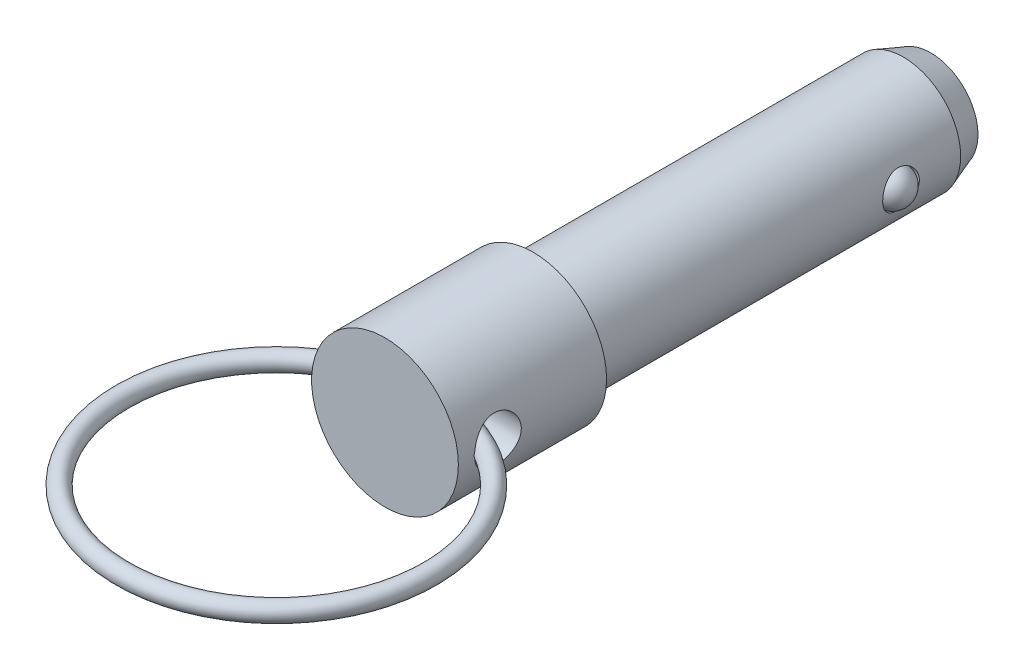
ISO-10303-21;
HEADER;
FILE_DESCRIPTION(('STEP AP214'),'2;1');
FILE_NAME('part.step','',(''),(''),'','','');
FILE_SCHEMA(('AUTOMOTIVE_DESIGN { 1 0 10303 214 1 1 1 1 }'));
ENDSEC;
DATA;
#1=APPLICATION_CONTEXT('core data for automotive mechanical design processes');
#2=APPLICATION_PROTOCOL_DEFINITION('international standard','automotive_design',2000,#1);
#3=PRODUCT_CONTEXT('',#1,'mechanical');
#4=PRODUCT('Part','Part','',(#3));
#5=PRODUCT_RELATED_PRODUCT_CATEGORY('part','',(#4));
#6=PRODUCT_DEFINITION_FORMATION('','',#4);
#7=PRODUCT_DEFINITION_CONTEXT('part definition',#1,'design');
#8=PRODUCT_DEFINITION('design','',#6,#7);
#9=PRODUCT_DEFINITION_SHAPE('','',#8);
#10=(LENGTH_UNIT() NAMED_UNIT(*) SI_UNIT(.MILLI.,.METRE.));
#11=(NAMED_UNIT(*) PLANE_ANGLE_UNIT() SI_UNIT($,.RADIAN.));
#12=(NAMED_UNIT(*) SI_UNIT($,.STERADIAN.) SOLID_ANGLE_UNIT());
#13=UNCERTAINTY_MEASURE_WITH_UNIT(LENGTH_MEASURE(1.E-05),#10,'distance_accuracy_value','');
#14=(GEOMETRIC_REPRESENTATION_CONTEXT(3) GLOBAL_UNCERTAINTY_ASSIGNED_CONTEXT((#13)) GLOBAL_UNIT_ASSIGNED_CONTEXT((#10,
#11,#12)) REPRESENTATION_CONTEXT('',''));
#15=CARTESIAN_POINT('',(0.,0.,0.));
#16=DIRECTION('',(0.,0.,1.));
#17=DIRECTION('',(1.,0.,0.));
#18=AXIS2_PLACEMENT_3D('',#15,#16,#17);
#19=CARTESIAN_POINT('',(7.9375,0.,9.398));
#20=DIRECTION('',(-1.,0.,0.));
#21=DIRECTION('',(0.,0.,-1.));
#22=AXIS2_PLACEMENT_3D('',#19,#20,#21);
#23=CYLINDRICAL_SURFACE('',#22,2.0193);
#24=CARTESIAN_POINT('',(-6.3502,0.292157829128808,11.3960531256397));
#25=CARTESIAN_POINT('',(-6.33446408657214,0.262361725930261,11.4004344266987));
#26=CARTESIAN_POINT('',(-6.32102794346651,0.23122551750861,11.4042829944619));
#27=CARTESIAN_POINT('',(-6.29925234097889,0.167152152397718,11.4106204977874));
#28=CARTESIAN_POINT('',(-6.29090461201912,0.13421801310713,11.413111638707));
#29=CARTESIAN_POINT('',(-6.27972917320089,0.0672091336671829,11.4164621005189));
#30=CARTESIAN_POINT('',(-6.27692077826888,0.0331308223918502,11.4173157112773));
#31=CARTESIAN_POINT('',(-6.27702601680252,-0.0350157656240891,11.4172838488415));
#32=CARTESIAN_POINT('',(-6.27993956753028,-0.0690840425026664,11.4163984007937));
#33=CARTESIAN_POINT('',(-6.29126629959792,-0.135748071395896,11.4130038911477));
#34=CARTESIAN_POINT('',(-6.2996097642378,-0.168356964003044,11.4105154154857));
#35=CARTESIAN_POINT('',(-6.32127848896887,-0.231802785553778,11.404211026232));
#36=CARTESIAN_POINT('',(-6.33461136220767,-0.262636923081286,11.4003930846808));
#37=CARTESIAN_POINT('',(-6.3502,-0.292157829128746,11.3960531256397));
#38=B_SPLINE_CURVE_WITH_KNOTS('',3,(#24,#25,#26,#27,#28,#29,#30,#31,#32,#33,#34,#35,#36,#37),
.UNSPECIFIED.,.F.,.F.,(4,2,2,2,2,2,4),(0.,0.101899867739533,0.203633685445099,0.305721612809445,
0.407808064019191,0.508608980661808,0.609564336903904),.UNSPECIFIED.);
#39=CARTESIAN_POINT('',(-6.3438349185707,0.279747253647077,11.3978284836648));
#40=VERTEX_POINT('',#39);
#41=CARTESIAN_POINT('',(-6.34383491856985,-0.279747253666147,11.3978284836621));
#42=VERTEX_POINT('',#41);
#43=EDGE_CURVE('E39',#40,#42,#38,.T.);
#44=ORIENTED_EDGE('',*,*,#43,.F.);
#45=CARTESIAN_POINT('',(-6.35,0.,11.4173));
#46=CARTESIAN_POINT('',(-6.34999578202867,-0.110312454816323,11.417293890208));
#47=CARTESIAN_POINT('',(-6.34709412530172,-0.220741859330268,11.4082188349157));
#48=CARTESIAN_POINT('',(-6.33578529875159,-0.438477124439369,11.3722159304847));
#49=CARTESIAN_POINT('',(-6.3273687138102,-0.545777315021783,11.3452575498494));
#50=CARTESIAN_POINT('',(-6.30595235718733,-0.753914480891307,11.2744960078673));
#51=CARTESIAN_POINT('',(-6.29296259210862,-0.854765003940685,11.2307296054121));
#52=CARTESIAN_POINT('',(-6.26374009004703,-1.04765917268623,11.1277235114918));
#53=CARTESIAN_POINT('',(-6.247507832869,-1.13970411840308,11.0684861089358));
#54=CARTESIAN_POINT('',(-6.2129360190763,-1.31536123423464,10.9342184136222));
#55=CARTESIAN_POINT('',(-6.19454917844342,-1.39865352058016,10.8587818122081));
#56=CARTESIAN_POINT('',(-6.15801023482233,-1.5516474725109,10.6951184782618));
#57=CARTESIAN_POINT('',(-6.13985819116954,-1.62134576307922,10.606888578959));
#58=CARTESIAN_POINT('',(-6.10533720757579,-1.74691684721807,10.4173629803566));
#59=CARTESIAN_POINT('',(-6.08902613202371,-1.80238797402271,10.315789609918));
#60=CARTESIAN_POINT('',(-6.06074349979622,-1.89532725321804,10.104153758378));
#61=CARTESIAN_POINT('',(-6.0487707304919,-1.93280043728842,9.99409365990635));
#62=CARTESIAN_POINT('',(-6.03101341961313,-1.98750760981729,9.77220930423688));
#63=CARTESIAN_POINT('',(-6.02504825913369,-2.00533395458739,9.66054596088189));
#64=CARTESIAN_POINT('',(-6.01944581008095,-2.02209234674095,9.43566621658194));
#65=CARTESIAN_POINT('',(-6.01980677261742,-2.02102961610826,9.32245025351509));
#66=CARTESIAN_POINT('',(-6.02665663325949,-2.00050250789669,9.10261826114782));
#67=CARTESIAN_POINT('',(-6.03289303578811,-1.98179631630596,8.99592223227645));
#68=CARTESIAN_POINT('',(-6.05038018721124,-1.92774435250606,8.78726894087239));
#69=CARTESIAN_POINT('',(-6.0616315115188,-1.89239667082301,8.68531222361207));
#70=CARTESIAN_POINT('',(-6.08807105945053,-1.8055389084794,8.48724541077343));
#71=CARTESIAN_POINT('',(-6.10331592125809,-1.75379385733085,8.39124624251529));
#72=CARTESIAN_POINT('',(-6.13599834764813,-1.63577635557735,8.20905256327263));
#73=CARTESIAN_POINT('',(-6.15343637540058,-1.56950083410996,8.12286013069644));
#74=CARTESIAN_POINT('',(-6.18954615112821,-1.42061516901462,7.95845350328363));
#75=CARTESIAN_POINT('',(-6.2082373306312,-1.33738288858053,7.88080597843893));
#76=CARTESIAN_POINT('',(-6.24403204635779,-1.15881168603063,7.74040227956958));
#77=CARTESIAN_POINT('',(-6.26113489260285,-1.0634675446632,7.67765255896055));
#78=CARTESIAN_POINT('',(-6.29201953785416,-0.862230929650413,7.56842117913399));
#79=CARTESIAN_POINT('',(-6.30576997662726,-0.756251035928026,7.52209142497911));
#80=CARTESIAN_POINT('',(-6.32815272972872,-0.537579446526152,7.44816775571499));
#81=CARTESIAN_POINT('',(-6.3367955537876,-0.424902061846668,7.4205353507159));
#82=CARTESIAN_POINT('',(-6.34491251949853,-0.259333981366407,7.39474486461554));
#83=CARTESIAN_POINT('',(-6.3468148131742,-0.207677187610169,7.38873516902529));
#84=CARTESIAN_POINT('',(-6.34935954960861,-0.104022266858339,7.38071129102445));
#85=CARTESIAN_POINT('',(-6.35000198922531,-0.0520241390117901,7.37869711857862));
#86=CARTESIAN_POINT('',(-6.34999578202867,0.110312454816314,7.37870610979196));
#87=CARTESIAN_POINT('',(-6.34709412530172,0.220741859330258,7.38778116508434));
#88=CARTESIAN_POINT('',(-6.33578529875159,0.438477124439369,7.42378406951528));
#89=CARTESIAN_POINT('',(-6.3273687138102,0.545777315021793,7.45074245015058));
#90=CARTESIAN_POINT('',(-6.30595235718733,0.753914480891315,7.52150399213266));
#91=CARTESIAN_POINT('',(-6.29296259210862,0.854765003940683,7.56527039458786));
#92=CARTESIAN_POINT('',(-6.26374009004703,1.04765917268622,7.66827648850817));
#93=CARTESIAN_POINT('',(-6.247507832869,1.13970411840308,7.72751389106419));
#94=CARTESIAN_POINT('',(-6.2129360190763,1.31536123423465,7.86178158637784));
#95=CARTESIAN_POINT('',(-6.19454917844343,1.39865352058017,7.93721818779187));
#96=CARTESIAN_POINT('',(-6.15801023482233,1.55164747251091,8.10088152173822));
#97=CARTESIAN_POINT('',(-6.13985819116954,1.62134576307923,8.18911142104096));
#98=CARTESIAN_POINT('',(-6.10533720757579,1.74691684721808,8.37863701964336));
#99=CARTESIAN_POINT('',(-6.08902613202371,1.80238797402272,8.48021039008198));
#100=CARTESIAN_POINT('',(-6.06074349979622,1.89532725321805,8.69184624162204));
#101=CARTESIAN_POINT('',(-6.0487707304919,1.93280043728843,8.80190634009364));
#102=CARTESIAN_POINT('',(-6.03101341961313,1.9875076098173,9.02379069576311));
#103=CARTESIAN_POINT('',(-6.02504825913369,2.0053339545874,9.13545403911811));
#104=CARTESIAN_POINT('',(-6.01944581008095,2.02209234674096,9.36033378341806));
#105=CARTESIAN_POINT('',(-6.01980677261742,2.02102961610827,9.47354974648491));
#106=CARTESIAN_POINT('',(-6.02665663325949,2.0005025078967,9.69338173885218));
#107=CARTESIAN_POINT('',(-6.03289303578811,1.98179631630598,9.80007776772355));
#108=CARTESIAN_POINT('',(-6.05038018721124,1.92774435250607,10.0087310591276));
#109=CARTESIAN_POINT('',(-6.06163151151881,1.89239667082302,10.1106877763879));
#110=CARTESIAN_POINT('',(-6.08807105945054,1.80553890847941,10.3087545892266));
#111=CARTESIAN_POINT('',(-6.1033159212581,1.75379385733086,10.4047537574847));
#112=CARTESIAN_POINT('',(-6.13599834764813,1.63577635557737,10.5869474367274));
#113=CARTESIAN_POINT('',(-6.15343637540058,1.56950083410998,10.6731398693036));
#114=CARTESIAN_POINT('',(-6.18954615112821,1.42061516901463,10.8375464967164));
#115=CARTESIAN_POINT('',(-6.2082373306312,1.33738288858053,10.9151940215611));
#116=CARTESIAN_POINT('',(-6.24403204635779,1.15881168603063,11.0555977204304));
#117=CARTESIAN_POINT('',(-6.26113489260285,1.06346754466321,11.1183474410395));
#118=CARTESIAN_POINT('',(-6.29201953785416,0.862230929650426,11.227578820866));
#119=CARTESIAN_POINT('',(-6.30576997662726,0.756251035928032,11.2739085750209));
#120=CARTESIAN_POINT('',(-6.32815272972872,0.537579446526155,11.347832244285));
#121=CARTESIAN_POINT('',(-6.3367955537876,0.424902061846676,11.3754646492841));
#122=CARTESIAN_POINT('',(-6.34491251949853,0.259333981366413,11.4012551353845));
#123=CARTESIAN_POINT('',(-6.3468148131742,0.207677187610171,11.4072648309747));
#124=CARTESIAN_POINT('',(-6.34935954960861,0.104022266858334,11.4152887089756));
#125=CARTESIAN_POINT('',(-6.35000198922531,0.0520241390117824,11.4173028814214));
#126=CARTESIAN_POINT('',(-6.35,0.,11.4173));
#127=B_SPLINE_CURVE_WITH_KNOTS('',3,(#45,#46,#47,#48,#49,#50,#51,#52,#53,#54,#55,#56,#57,#58,
#59,#60,#61,#62,#63,#64,#65,#66,#67,#68,#69,#70,#71,#72,#73,#74,#75,#76,#77,#78,#79,#80,#81,#82,
#83,#84,#85,#86,#87,#88,#89,#90,#91,#92,#93,#94,#95,#96,#97,#98,#99,#100,#101,#102,#103,#104,
#105,#106,#107,#108,#109,#110,#111,#112,#113,#114,#115,#116,#117,#118,#119,#120,#121,#122,#123,
#124,#125,#126),.UNSPECIFIED.,.T.,.F.,(4,2,2,2,2,2,2,2,2,2,2,2,2,2,2,2,2,2,2,2,2,2,2,2,2,2,2,2,
2,2,2,2,2,2,2,2,2,2,2,2,4),(0.,0.33073688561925,0.662039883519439,0.992622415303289,
1.32315606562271,1.66322530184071,2.00337886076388,2.35228054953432,2.70108463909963,
3.0390572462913,3.37693642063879,3.7009272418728,4.02495524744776,4.35385413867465,
4.68282260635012,5.02727904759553,5.37188442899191,5.71959937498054,6.06659632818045,
6.22257380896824,6.37855167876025,6.7092885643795,7.04059156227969,7.37117409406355,
7.70170774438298,8.04177698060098,8.38193053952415,8.73083222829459,9.07963631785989,
9.41760892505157,9.75548809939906,10.0794789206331,10.403506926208,10.7324058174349,
11.0613742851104,11.4058307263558,11.7504361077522,12.0981510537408,12.4451480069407,
12.6011254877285,12.7571033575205),.UNSPECIFIED.);
#128=EDGE_CURVE('E65',#42,#40,#127,.T.);
#129=ORIENTED_EDGE('',*,*,#128,.F.);
#130=EDGE_LOOP('',(#44,#129));
#131=FACE_BOUND('',#130,.T.);
#132=CARTESIAN_POINT('',(6.3502,-0.292157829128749,11.3960531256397));
#133=CARTESIAN_POINT('',(6.33446408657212,-0.262361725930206,11.4004344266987));
#134=CARTESIAN_POINT('',(6.3210279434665,-0.231225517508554,11.4042829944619));
#135=CARTESIAN_POINT('',(6.29925234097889,-0.167152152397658,11.4106204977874));
#136=CARTESIAN_POINT('',(6.29090461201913,-0.134218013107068,11.413111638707));
#137=CARTESIAN_POINT('',(6.2797291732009,-0.0672091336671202,11.4164621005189));
#138=CARTESIAN_POINT('',(6.27692077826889,-0.0331308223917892,11.4173157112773));
#139=CARTESIAN_POINT('',(6.27702601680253,0.0350157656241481,11.4172838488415));
#140=CARTESIAN_POINT('',(6.27993956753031,0.0690840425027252,11.4163984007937));
#141=CARTESIAN_POINT('',(6.29126629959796,0.135748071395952,11.4130038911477));
#142=CARTESIAN_POINT('',(6.29960976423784,0.168356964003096,11.4105154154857));
#143=CARTESIAN_POINT('',(6.32127848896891,0.231802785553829,11.4042110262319));
#144=CARTESIAN_POINT('',(6.3346113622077,0.262636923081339,11.4003930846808));
#145=CARTESIAN_POINT('',(6.3502,0.292157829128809,11.3960531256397));
#146=B_SPLINE_CURVE_WITH_KNOTS('',3,(#132,#133,#134,#135,#136,#137,#138,#139,#140,#141,#142,
#143,#144,#145),.UNSPECIFIED.,.F.,.F.,(4,2,2,2,2,2,4),(0.,0.101899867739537,0.203633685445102,
0.305721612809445,0.407808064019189,0.508608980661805,0.609564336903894),.UNSPECIFIED.);
#147=CARTESIAN_POINT('',(6.3438349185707,-0.279747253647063,11.3978284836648));
#148=VERTEX_POINT('',#147);
#149=CARTESIAN_POINT('',(6.34383491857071,0.27974725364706,11.3978284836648));
#150=VERTEX_POINT('',#149);
#151=EDGE_CURVE('E32',#148,#150,#146,.T.);
#152=ORIENTED_EDGE('',*,*,#151,.F.);
#153=CARTESIAN_POINT('',(6.35,0.,7.3787));
#154=CARTESIAN_POINT('',(6.34999578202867,-0.11031245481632,7.37870610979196));
#155=CARTESIAN_POINT('',(6.34709412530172,-0.220741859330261,7.38778116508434));
#156=CARTESIAN_POINT('',(6.3357852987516,-0.438477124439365,7.42378406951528));
#157=CARTESIAN_POINT('',(6.32736871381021,-0.545777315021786,7.45074245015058));
#158=CARTESIAN_POINT('',(6.30595235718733,-0.753914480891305,7.52150399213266));
#159=CARTESIAN_POINT('',(6.29296259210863,-0.854765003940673,7.56527039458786));
#160=CARTESIAN_POINT('',(6.26374009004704,-1.04765917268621,7.66827648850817));
#161=CARTESIAN_POINT('',(6.24750783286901,-1.13970411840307,7.72751389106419));
#162=CARTESIAN_POINT('',(6.2129360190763,-1.31536123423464,7.86178158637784));
#163=CARTESIAN_POINT('',(6.19454917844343,-1.39865352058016,7.93721818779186));
#164=CARTESIAN_POINT('',(6.15801023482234,-1.5516474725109,8.10088152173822));
#165=CARTESIAN_POINT('',(6.13985819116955,-1.62134576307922,8.18911142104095));
#166=CARTESIAN_POINT('',(6.1053372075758,-1.74691684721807,8.37863701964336));
#167=CARTESIAN_POINT('',(6.08902613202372,-1.80238797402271,8.48021039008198));
#168=CARTESIAN_POINT('',(6.06074349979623,-1.89532725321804,8.69184624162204));
#169=CARTESIAN_POINT('',(6.04877073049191,-1.93280043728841,8.80190634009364));
#170=CARTESIAN_POINT('',(6.03101341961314,-1.98750760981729,9.02379069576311));
#171=CARTESIAN_POINT('',(6.02504825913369,-2.00533395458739,9.13545403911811));
#172=CARTESIAN_POINT('',(6.01944581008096,-2.02209234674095,9.36033378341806));
#173=CARTESIAN_POINT('',(6.01980677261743,-2.02102961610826,9.47354974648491));
#174=CARTESIAN_POINT('',(6.0266566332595,-2.00050250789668,9.69338173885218));
#175=CARTESIAN_POINT('',(6.03289303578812,-1.98179631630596,9.80007776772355));
#176=CARTESIAN_POINT('',(6.05038018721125,-1.92774435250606,10.0087310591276));
#177=CARTESIAN_POINT('',(6.06163151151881,-1.89239667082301,10.1106877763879));
#178=CARTESIAN_POINT('',(6.08807105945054,-1.8055389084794,10.3087545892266));
#179=CARTESIAN_POINT('',(6.1033159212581,-1.75379385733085,10.4047537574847));
#180=CARTESIAN_POINT('',(6.13599834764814,-1.63577635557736,10.5869474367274));
#181=CARTESIAN_POINT('',(6.15343637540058,-1.56950083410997,10.6731398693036));
#182=CARTESIAN_POINT('',(6.18954615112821,-1.42061516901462,10.8375464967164));
#183=CARTESIAN_POINT('',(6.20823733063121,-1.33738288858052,10.9151940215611));
#184=CARTESIAN_POINT('',(6.2440320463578,-1.15881168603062,11.0555977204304));
#185=CARTESIAN_POINT('',(6.26113489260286,-1.0634675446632,11.1183474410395));
#186=CARTESIAN_POINT('',(6.29201953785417,-0.862230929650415,11.227578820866));
#187=CARTESIAN_POINT('',(6.30576997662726,-0.75625103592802,11.2739085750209));
#188=CARTESIAN_POINT('',(6.32815272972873,-0.537579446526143,11.347832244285));
#189=CARTESIAN_POINT('',(6.33679555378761,-0.424902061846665,11.3754646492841));
#190=CARTESIAN_POINT('',(6.34491251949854,-0.259333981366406,11.4012551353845));
#191=CARTESIAN_POINT('',(6.34681481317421,-0.207677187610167,11.4072648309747));
#192=CARTESIAN_POINT('',(6.34935954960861,-0.104022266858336,11.4152887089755));
#193=CARTESIAN_POINT('',(6.35000198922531,-0.0520241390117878,11.4173028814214));
#194=CARTESIAN_POINT('',(6.34999578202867,0.110312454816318,11.417293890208));
#195=CARTESIAN_POINT('',(6.34709412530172,0.220741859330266,11.4082188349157));
#196=CARTESIAN_POINT('',(6.3357852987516,0.438477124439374,11.3722159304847));
#197=CARTESIAN_POINT('',(6.32736871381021,0.545777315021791,11.3452575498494));
#198=CARTESIAN_POINT('',(6.30595235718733,0.753914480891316,11.2744960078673));
#199=CARTESIAN_POINT('',(6.29296259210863,0.854765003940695,11.2307296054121));
#200=CARTESIAN_POINT('',(6.26374009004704,1.04765917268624,11.1277235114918));
#201=CARTESIAN_POINT('',(6.24750783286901,1.13970411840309,11.0684861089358));
#202=CARTESIAN_POINT('',(6.2129360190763,1.31536123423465,10.9342184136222));
#203=CARTESIAN_POINT('',(6.19454917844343,1.39865352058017,10.8587818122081));
#204=CARTESIAN_POINT('',(6.15801023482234,1.55164747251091,10.6951184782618));
#205=CARTESIAN_POINT('',(6.13985819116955,1.62134576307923,10.606888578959));
#206=CARTESIAN_POINT('',(6.1053372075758,1.74691684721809,10.4173629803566));
#207=CARTESIAN_POINT('',(6.08902613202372,1.80238797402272,10.315789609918));
#208=CARTESIAN_POINT('',(6.06074349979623,1.89532725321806,10.104153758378));
#209=CARTESIAN_POINT('',(6.04877073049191,1.93280043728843,9.99409365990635));
#210=CARTESIAN_POINT('',(6.03101341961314,1.98750760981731,9.77220930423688));
#211=CARTESIAN_POINT('',(6.02504825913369,2.0053339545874,9.66054596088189));
#212=CARTESIAN_POINT('',(6.01944581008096,2.02209234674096,9.43566621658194));
#213=CARTESIAN_POINT('',(6.01980677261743,2.02102961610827,9.32245025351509));
#214=CARTESIAN_POINT('',(6.0266566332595,2.0005025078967,9.10261826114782));
#215=CARTESIAN_POINT('',(6.03289303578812,1.98179631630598,8.99592223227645));
#216=CARTESIAN_POINT('',(6.05038018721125,1.92774435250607,8.78726894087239));
#217=CARTESIAN_POINT('',(6.06163151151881,1.89239667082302,8.68531222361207));
#218=CARTESIAN_POINT('',(6.08807105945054,1.80553890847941,8.48724541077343));
#219=CARTESIAN_POINT('',(6.1033159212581,1.75379385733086,8.39124624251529));
#220=CARTESIAN_POINT('',(6.13599834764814,1.63577635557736,8.20905256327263));
#221=CARTESIAN_POINT('',(6.15343637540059,1.56950083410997,8.12286013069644));
#222=CARTESIAN_POINT('',(6.18954615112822,1.42061516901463,7.95845350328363));
#223=CARTESIAN_POINT('',(6.20823733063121,1.33738288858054,7.88080597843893));
#224=CARTESIAN_POINT('',(6.2440320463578,1.15881168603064,7.74040227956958));
#225=CARTESIAN_POINT('',(6.26113489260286,1.06346754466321,7.67765255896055));
#226=CARTESIAN_POINT('',(6.29201953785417,0.862230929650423,7.56842117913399));
#227=CARTESIAN_POINT('',(6.30576997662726,0.756251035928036,7.52209142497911));
#228=CARTESIAN_POINT('',(6.32815272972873,0.537579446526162,7.44816775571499));
#229=CARTESIAN_POINT('',(6.33679555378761,0.424902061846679,7.4205353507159));
#230=CARTESIAN_POINT('',(6.34491251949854,0.259333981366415,7.39474486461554));
#231=CARTESIAN_POINT('',(6.34681481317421,0.207677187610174,7.38873516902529));
#232=CARTESIAN_POINT('',(6.34935954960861,0.104022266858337,7.38071129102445));
#233=CARTESIAN_POINT('',(6.35000198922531,0.0520241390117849,7.37869711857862));
#234=CARTESIAN_POINT('',(6.35,0.,7.3787));
#235=B_SPLINE_CURVE_WITH_KNOTS('',3,(#153,#154,#155,#156,#157,#158,#159,#160,#161,#162,#163,
#164,#165,#166,#167,#168,#169,#170,#171,#172,#173,#174,#175,#176,#177,#178,#179,#180,#181,#182,
#183,#184,#185,#186,#187,#188,#189,#190,#191,#192,#193,#194,#195,#196,#197,#198,#199,#200,#201,
#202,#203,#204,#205,#206,#207,#208,#209,#210,#211,#212,#213,#214,#215,#216,#217,#218,#219,#220,
#221,#222,#223,#224,#225,#226,#227,#228,#229,#230,#231,#232,#233,#234),.UNSPECIFIED.,.T.,.F.,(4,
2,2,2,2,2,2,2,2,2,2,2,2,2,2,2,2,2,2,2,2,2,2,2,2,2,2,2,2,2,2,2,2,2,2,2,2,2,2,2,4),(0.,
0.330736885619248,0.662039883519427,0.992622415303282,1.32315606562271,1.66322530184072,
2.00337886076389,2.35228054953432,2.70108463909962,3.03905724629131,3.3769364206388,
3.70092724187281,4.02495524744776,4.35385413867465,4.68282260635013,5.02727904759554,
5.37188442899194,5.71959937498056,6.06659632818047,6.22257380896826,6.37855167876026,
6.70928856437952,7.04059156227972,7.37117409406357,7.70170774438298,8.04177698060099,
8.38193053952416,8.7308322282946,9.07963631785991,9.41760892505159,9.75548809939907,
10.0794789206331,10.403506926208,10.7324058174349,11.0613742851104,11.4058307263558,
11.7504361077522,12.0981510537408,12.4451480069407,12.6011254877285,12.7571033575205),.UNSPECIFIED.);
#236=EDGE_CURVE('E61',#150,#148,#235,.T.);
#237=ORIENTED_EDGE('',*,*,#236,.F.);
#238=EDGE_LOOP('',(#152,#237));
#239=FACE_BOUND('',#238,.T.);
#240=ADVANCED_FACE('F14',(#131,#239),#23,.F.);
#241=CARTESIAN_POINT('',(0.,0.,-34.39922));
#242=DIRECTION('',(0.,0.,-1.));
#243=DIRECTION('',(1.,0.,0.));
#244=AXIS2_PLACEMENT_3D('',#241,#242,#243);
#245=CYLINDRICAL_SURFACE('',#244,6.35);
#246=ORIENTED_EDGE('',*,*,#236,.T.);
#247=CARTESIAN_POINT('',(6.34665582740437,-0.206057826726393,9.6663673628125));
#248=CARTESIAN_POINT('',(6.34528498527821,-0.248279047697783,9.67828523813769));
#249=CARTESIAN_POINT('',(6.34352249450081,-0.289459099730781,9.69386090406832));
#250=CARTESIAN_POINT('',(6.33942011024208,-0.36854309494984,9.7317801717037));
#251=CARTESIAN_POINT('',(6.33708008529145,-0.406446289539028,9.75412531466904));
#252=CARTESIAN_POINT('',(6.33209241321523,-0.477899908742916,9.8047666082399));
#253=CARTESIAN_POINT('',(6.32944535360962,-0.511458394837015,9.83305147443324));
#254=CARTESIAN_POINT('',(6.32412241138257,-0.573540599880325,9.89467297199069));
#255=CARTESIAN_POINT('',(6.32144652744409,-0.602064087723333,9.92800983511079));
#256=CARTESIAN_POINT('',(6.31623478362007,-0.654523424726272,10.0000464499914));
#257=CARTESIAN_POINT('',(6.31370785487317,-0.678248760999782,10.0388997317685));
#258=CARTESIAN_POINT('',(6.30914807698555,-0.719430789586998,10.1198151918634));
#259=CARTESIAN_POINT('',(6.30711537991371,-0.736885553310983,10.1618783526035));
#260=CARTESIAN_POINT('',(6.30356963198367,-0.766652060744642,10.2517585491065));
#261=CARTESIAN_POINT('',(6.3021147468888,-0.778407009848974,10.2997618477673));
#262=CARTESIAN_POINT('',(6.30009638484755,-0.794575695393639,10.3969997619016));
#263=CARTESIAN_POINT('',(6.29953326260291,-0.79898651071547,10.4462348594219));
#264=CARTESIAN_POINT('',(6.29930439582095,-0.800791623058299,10.5499764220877));
#265=CARTESIAN_POINT('',(6.29973840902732,-0.797405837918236,10.6044969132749));
#266=CARTESIAN_POINT('',(6.30162771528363,-0.782332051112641,10.7123814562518));
#267=CARTESIAN_POINT('',(6.30308376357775,-0.770637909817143,10.7657446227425));
#268=CARTESIAN_POINT('',(6.30699495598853,-0.737976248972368,10.8743575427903));
#269=CARTESIAN_POINT('',(6.30952256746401,-0.716323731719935,10.9294001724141));
#270=CARTESIAN_POINT('',(6.31524450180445,-0.663986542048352,11.0349896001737));
#271=CARTESIAN_POINT('',(6.31843852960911,-0.633305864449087,11.0855383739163));
#272=CARTESIAN_POINT('',(6.32446092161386,-0.569663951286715,11.1714846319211));
#273=CARTESIAN_POINT('',(6.32724886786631,-0.538153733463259,11.2079604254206));
#274=CARTESIAN_POINT('',(6.33270636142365,-0.46958313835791,11.2752665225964));
#275=CARTESIAN_POINT('',(6.33537605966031,-0.432530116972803,11.3061041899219));
#276=CARTESIAN_POINT('',(6.33987873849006,-0.359908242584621,11.3561064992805));
#277=CARTESIAN_POINT('',(6.34177713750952,-0.325092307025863,11.3763560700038));
#278=CARTESIAN_POINT('',(6.34507913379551,-0.252556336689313,11.4108259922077));
#279=CARTESIAN_POINT('',(6.34648300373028,-0.214837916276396,11.4250496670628));
#280=CARTESIAN_POINT('',(6.34863622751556,-0.137224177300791,11.4466382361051));
#281=CARTESIAN_POINT('',(6.34938200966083,-0.0973182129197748,11.4539657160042));
#282=CARTESIAN_POINT('',(6.35010496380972,-0.01683349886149,11.4610716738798));
#283=CARTESIAN_POINT('',(6.35008242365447,0.0237449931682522,11.4608529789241));
#284=CARTESIAN_POINT('',(6.34931136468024,0.100393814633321,11.4532686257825));
#285=CARTESIAN_POINT('',(6.34863038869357,0.136533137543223,11.4465678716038));
#286=CARTESIAN_POINT('',(6.34671646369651,0.207223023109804,11.4274006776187));
#287=CARTESIAN_POINT('',(6.34548344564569,0.241773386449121,11.4149335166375));
#288=CARTESIAN_POINT('',(6.34254165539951,0.309606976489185,11.3844132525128));
#289=CARTESIAN_POINT('',(6.34081891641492,0.342814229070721,11.3661941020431));
#290=CARTESIAN_POINT('',(6.33707366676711,0.406211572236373,11.3251453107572));
#291=CARTESIAN_POINT('',(6.33505103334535,0.436400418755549,11.3023137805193));
#292=CARTESIAN_POINT('',(6.33055131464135,0.497695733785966,11.2491439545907));
#293=CARTESIAN_POINT('',(6.32805141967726,0.528268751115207,11.2181940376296));
#294=CARTESIAN_POINT('',(6.32308163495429,0.584759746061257,11.1523092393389));
#295=CARTESIAN_POINT('',(6.32061176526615,0.610674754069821,11.1173718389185));
#296=CARTESIAN_POINT('',(6.315456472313,0.662038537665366,11.0376631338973));
#297=CARTESIAN_POINT('',(6.31281513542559,0.686522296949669,10.9922657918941));
#298=CARTESIAN_POINT('',(6.30810097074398,0.728566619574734,10.8983369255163));
#299=CARTESIAN_POINT('',(6.30602851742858,0.74612262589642,10.8498033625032));
#300=CARTESIAN_POINT('',(6.30243933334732,0.775896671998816,10.7442183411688));
#301=CARTESIAN_POINT('',(6.30103001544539,0.787122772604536,10.6868803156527));
#302=CARTESIAN_POINT('',(6.29940721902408,0.800007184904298,10.5710986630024));
#303=CARTESIAN_POINT('',(6.29919407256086,0.801662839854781,10.5126547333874));
#304=CARTESIAN_POINT('',(6.30005021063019,0.794909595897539,10.3956729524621));
#305=CARTESIAN_POINT('',(6.30113381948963,0.786388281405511,10.3371413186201));
#306=CARTESIAN_POINT('',(6.30452399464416,0.758730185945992,10.2226628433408));
#307=CARTESIAN_POINT('',(6.30682981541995,0.739599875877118,10.1667144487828));
#308=CARTESIAN_POINT('',(6.31212037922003,0.692916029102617,10.0644672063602));
#309=CARTESIAN_POINT('',(6.31502617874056,0.666266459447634,10.0177527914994));
#310=CARTESIAN_POINT('',(6.32122790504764,0.604592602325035,9.93024699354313));
#311=CARTESIAN_POINT('',(6.32452352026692,0.569574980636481,9.88945093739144));
#312=CARTESIAN_POINT('',(6.33066231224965,0.496394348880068,9.81967919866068));
#313=CARTESIAN_POINT('',(6.33351542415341,0.458999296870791,9.78989736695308));
#314=CARTESIAN_POINT('',(6.33878167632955,0.379383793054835,9.7376345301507));
#315=CARTESIAN_POINT('',(6.34119502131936,0.337165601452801,9.71515012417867));
#316=CARTESIAN_POINT('',(6.34510608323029,0.252558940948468,9.67976956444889));
#317=CARTESIAN_POINT('',(6.34665878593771,0.210419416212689,9.66628201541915));
#318=CARTESIAN_POINT('',(6.34892624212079,0.124425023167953,9.64681261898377));
#319=CARTESIAN_POINT('',(6.34964132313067,0.0805708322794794,9.64082783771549));
#320=CARTESIAN_POINT('',(6.3501300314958,-0.00429887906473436,9.63672685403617));
#321=CARTESIAN_POINT('',(6.3499683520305,-0.0452888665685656,9.63806999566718));
#322=CARTESIAN_POINT('',(6.34886964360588,-0.126506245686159,9.64734016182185));
#323=CARTESIAN_POINT('',(6.34793260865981,-0.16673363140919,9.65526723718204));
#324=CARTESIAN_POINT('',(6.34665582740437,-0.206057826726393,9.6663673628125));
#325=B_SPLINE_CURVE_WITH_KNOTS('',3,(#247,#248,#249,#250,#251,#252,#253,#254,#255,#256,#257,
#258,#259,#260,#261,#262,#263,#264,#265,#266,#267,#268,#269,#270,#271,#272,#273,#274,#275,#276,
#277,#278,#279,#280,#281,#282,#283,#284,#285,#286,#287,#288,#289,#290,#291,#292,#293,#294,#295,
#296,#297,#298,#299,#300,#301,#302,#303,#304,#305,#306,#307,#308,#309,#310,#311,#312,#313,#314,
#315,#316,#317,#318,#319,#320,#321,#322,#323,#324),.UNSPECIFIED.,.T.,.F.,(4,2,2,2,2,2,2,2,2,2,2,
2,2,2,2,2,2,2,2,2,2,2,2,2,2,2,2,2,2,2,2,2,2,2,2,2,2,2,4),(0.,0.131523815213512,
0.263077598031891,0.394383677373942,0.525695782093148,0.661900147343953,0.798146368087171,
0.945864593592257,1.09364155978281,1.25683680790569,1.42015277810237,1.59693202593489,
1.7736331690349,1.91791685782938,2.06201073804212,2.1824766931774,2.30287612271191,
2.42392505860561,2.54492864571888,2.65470676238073,2.76449861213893,2.87780525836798,
2.99115841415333,3.12140054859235,3.25172542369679,3.40605418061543,3.56048428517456,
3.73501068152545,3.90958552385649,4.08610670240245,4.2625203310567,4.42319186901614,
4.58373584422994,4.72664586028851,4.86948917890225,5.00164792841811,5.13375498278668,
5.25625329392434,5.37875255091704),.UNSPECIFIED.);
#326=EDGE_CURVE('E26',#148,#150,#325,.T.);
#327=ORIENTED_EDGE('',*,*,#326,.T.);
#328=EDGE_LOOP('',(#246,#327));
#329=FACE_BOUND('',#328,.T.);
#330=CARTESIAN_POINT('',(0.,0.,12.8270000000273));
#331=DIRECTION('',(0.,0.,-1.));
#332=DIRECTION('',(1.,0.,0.));
#333=AXIS2_PLACEMENT_3D('',#330,#331,#332);
#334=CIRCLE('',#333,6.34999999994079);
#335=CARTESIAN_POINT('',(6.34999999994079,0.,12.8270000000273));
#336=VERTEX_POINT('',#335);
#337=EDGE_CURVE('E70',#336,#336,#334,.T.);
#338=ORIENTED_EDGE('',*,*,#337,.T.);
#339=EDGE_LOOP('',(#338));
#340=FACE_BOUND('',#339,.T.);
#341=CARTESIAN_POINT('',(0.,0.,1.16018306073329E-11));
#342=DIRECTION('',(0.,0.,-1.));
#343=DIRECTION('',(1.,0.,0.));
#344=AXIS2_PLACEMENT_3D('',#341,#342,#343);
#345=CIRCLE('',#344,6.34999999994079);
#346=CARTESIAN_POINT('',(6.3499999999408,0.,1.16015507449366E-11));
#347=VERTEX_POINT('',#346);
#348=EDGE_CURVE('E280',#347,#347,#345,.T.);
#349=ORIENTED_EDGE('',*,*,#348,.F.);
#350=EDGE_LOOP('',(#349));
#351=FACE_BOUND('',#350,.T.);
#352=ORIENTED_EDGE('',*,*,#128,.T.);
#353=CARTESIAN_POINT('',(-6.34665582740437,-0.206057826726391,9.6663673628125));
#354=CARTESIAN_POINT('',(-6.34797934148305,-0.165285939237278,9.65485950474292));
#355=CARTESIAN_POINT('',(-6.34893816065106,-0.123532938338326,9.64675937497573));
#356=CARTESIAN_POINT('',(-6.35001869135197,-0.0392395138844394,9.63764831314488));
#357=CARTESIAN_POINT('',(-6.35014017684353,0.00330111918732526,9.63663929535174));
#358=CARTESIAN_POINT('',(-6.34953206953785,0.0879394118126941,9.64174776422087));
#359=CARTESIAN_POINT('',(-6.34880260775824,0.13003713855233,9.6478641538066));
#360=CARTESIAN_POINT('',(-6.34657447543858,0.212600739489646,9.66701677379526));
#361=CARTESIAN_POINT('',(-6.34507584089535,0.253066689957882,9.68005268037));
#362=CARTESIAN_POINT('',(-6.34146900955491,0.33138158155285,9.7126623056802));
#363=CARTESIAN_POINT('',(-6.33935898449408,0.36922224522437,9.73225566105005));
#364=CARTESIAN_POINT('',(-6.33475813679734,0.441182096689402,9.77733154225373));
#365=CARTESIAN_POINT('',(-6.33226728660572,0.47530101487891,9.80281449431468));
#366=CARTESIAN_POINT('',(-6.32708436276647,0.539990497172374,9.85971055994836));
#367=CARTESIAN_POINT('',(-6.3243885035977,0.570424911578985,9.89127784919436));
#368=CARTESIAN_POINT('',(-6.3191381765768,0.625916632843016,9.95882994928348));
#369=CARTESIAN_POINT('',(-6.31658374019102,0.650972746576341,9.9948157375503));
#370=CARTESIAN_POINT('',(-6.31170869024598,0.696703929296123,10.0724886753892));
#371=CARTESIAN_POINT('',(-6.30941195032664,0.717017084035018,10.1143899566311));
#372=CARTESIAN_POINT('',(-6.30545539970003,0.751016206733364,10.2008200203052));
#373=CARTESIAN_POINT('',(-6.30379582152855,0.764699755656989,10.245349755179));
#374=CARTESIAN_POINT('',(-6.30112261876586,0.786439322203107,10.3401349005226));
#375=CARTESIAN_POINT('',(-6.30018307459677,0.793856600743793,10.3905385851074));
#376=CARTESIAN_POINT('',(-6.29927265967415,0.801046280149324,10.4918905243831));
#377=CARTESIAN_POINT('',(-6.2993021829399,0.80081557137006,10.5428389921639));
#378=CARTESIAN_POINT('',(-6.30034248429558,0.792594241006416,10.6494235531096));
#379=CARTESIAN_POINT('',(-6.30145478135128,0.783800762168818,10.7049973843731));
#380=CARTESIAN_POINT('',(-6.30465473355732,0.75762808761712,10.8140964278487));
#381=CARTESIAN_POINT('',(-6.30674324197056,0.740241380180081,10.8676198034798));
#382=CARTESIAN_POINT('',(-6.31179783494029,0.695872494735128,10.9743734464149));
#383=CARTESIAN_POINT('',(-6.31480965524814,0.668369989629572,11.0273869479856));
#384=CARTESIAN_POINT('',(-6.32125797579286,0.604341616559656,11.127620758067));
#385=CARTESIAN_POINT('',(-6.32469393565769,0.567827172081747,11.1748482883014));
#386=CARTESIAN_POINT('',(-6.33064540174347,0.496358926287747,11.2504526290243));
#387=CARTESIAN_POINT('',(-6.33317742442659,0.463272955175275,11.2805972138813));
#388=CARTESIAN_POINT('',(-6.3379511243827,0.392589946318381,11.3350975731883));
#389=CARTESIAN_POINT('',(-6.3401929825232,0.35499574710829,11.3594569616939));
#390=CARTESIAN_POINT('',(-6.34414022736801,0.275631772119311,11.4012144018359));
#391=CARTESIAN_POINT('',(-6.34584084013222,0.233828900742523,11.418550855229));
#392=CARTESIAN_POINT('',(-6.34843013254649,0.147595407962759,11.4446164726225));
#393=CARTESIAN_POINT('',(-6.34931975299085,0.103167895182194,11.4533556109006));
#394=CARTESIAN_POINT('',(-6.35008514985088,0.0199378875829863,11.4608753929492));
#395=CARTESIAN_POINT('',(-6.35008843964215,-0.0187536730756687,11.4609085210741));
#396=CARTESIAN_POINT('',(-6.34939746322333,-0.09551707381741,11.4541183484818));
#397=CARTESIAN_POINT('',(-6.34870331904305,-0.13358902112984,11.4472962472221));
#398=CARTESIAN_POINT('',(-6.34675486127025,-0.206035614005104,11.4277870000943));
#399=CARTESIAN_POINT('',(-6.34553149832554,-0.240499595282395,11.4154227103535));
#400=CARTESIAN_POINT('',(-6.34265636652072,-0.307121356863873,11.3856122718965));
#401=CARTESIAN_POINT('',(-6.34100449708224,-0.339278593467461,11.3681649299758));
#402=CARTESIAN_POINT('',(-6.3372369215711,-0.403825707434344,11.3269948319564));
#403=CARTESIAN_POINT('',(-6.33509154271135,-0.435925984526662,11.3028229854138));
#404=CARTESIAN_POINT('',(-6.33064272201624,-0.496369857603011,11.250192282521));
#405=CARTESIAN_POINT('',(-6.32833919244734,-0.524711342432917,11.2217310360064));
#406=CARTESIAN_POINT('',(-6.32334030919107,-0.582098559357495,11.1560085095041));
#407=CARTESIAN_POINT('',(-6.32064774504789,-0.610381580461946,11.118081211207));
#408=CARTESIAN_POINT('',(-6.31552631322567,-0.661272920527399,11.0385798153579));
#409=CARTESIAN_POINT('',(-6.31309762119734,-0.683877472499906,10.9970033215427));
#410=CARTESIAN_POINT('',(-6.30833642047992,-0.726588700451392,10.9038901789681));
#411=CARTESIAN_POINT('',(-6.30608942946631,-0.745628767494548,10.851857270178));
#412=CARTESIAN_POINT('',(-6.30248979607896,-0.775466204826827,10.7454330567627));
#413=CARTESIAN_POINT('',(-6.30113765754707,-0.786258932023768,10.69104044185));
#414=CARTESIAN_POINT('',(-6.29944352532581,-0.799728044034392,10.5770263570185));
#415=CARTESIAN_POINT('',(-6.29918591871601,-0.801726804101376,10.5173211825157));
#416=CARTESIAN_POINT('',(-6.30000525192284,-0.795264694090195,10.3984664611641));
#417=CARTESIAN_POINT('',(-6.30108195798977,-0.786805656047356,10.3393168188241));
#418=CARTESIAN_POINT('',(-6.30440515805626,-0.759704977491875,10.2262823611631));
#419=CARTESIAN_POINT('',(-6.30659553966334,-0.741549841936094,10.1722805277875));
#420=CARTESIAN_POINT('',(-6.31185428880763,-0.695364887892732,10.0687073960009));
#421=CARTESIAN_POINT('',(-6.31492202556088,-0.66734216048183,10.0191329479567));
#422=CARTESIAN_POINT('',(-6.32113146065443,-0.605515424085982,9.93168975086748));
#423=CARTESIAN_POINT('',(-6.32422841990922,-0.572678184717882,9.89313380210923));
#424=CARTESIAN_POINT('',(-6.33035789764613,-0.500375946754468,9.82285661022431));
#425=CARTESIAN_POINT('',(-6.3333904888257,-0.460918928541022,9.79112724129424));
#426=CARTESIAN_POINT('',(-6.33833786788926,-0.386069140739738,9.74204682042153));
#427=CARTESIAN_POINT('',(-6.34035098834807,-0.351739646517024,9.72306715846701));
#428=CARTESIAN_POINT('',(-6.34389840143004,-0.28057152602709,9.69054512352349));
#429=CARTESIAN_POINT('',(-6.3454328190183,-0.243733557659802,9.67700133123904));
#430=CARTESIAN_POINT('',(-6.34665582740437,-0.206057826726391,9.6663673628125));
#431=B_SPLINE_CURVE_WITH_KNOTS('',3,(#353,#354,#355,#356,#357,#358,#359,#360,#361,#362,#363,
#364,#365,#366,#367,#368,#369,#370,#371,#372,#373,#374,#375,#376,#377,#378,#379,#380,#381,#382,
#383,#384,#385,#386,#387,#388,#389,#390,#391,#392,#393,#394,#395,#396,#397,#398,#399,#400,#401,
#402,#403,#404,#405,#406,#407,#408,#409,#410,#411,#412,#413,#414,#415,#416,#417,#418,#419,#420,
#421,#422,#423,#424,#425,#426,#427,#428,#429,#430),.UNSPECIFIED.,.T.,.F.,(4,2,2,2,2,2,2,2,2,2,2,
2,2,2,2,2,2,2,2,2,2,2,2,2,2,2,2,2,2,2,2,2,2,2,2,2,2,2,4),(0.,0.127017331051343,
0.254068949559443,0.381101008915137,0.508127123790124,0.635537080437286,0.762956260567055,
0.894175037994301,1.0254228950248,1.16470220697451,1.30403230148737,1.45626942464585,
1.60856844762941,1.7766734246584,1.94492561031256,2.12343441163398,2.30171808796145,
2.43568966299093,2.56957732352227,2.70461513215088,2.83949608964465,2.95496006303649,
3.07040383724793,3.17985460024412,3.28933107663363,3.40960027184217,3.52993673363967,
3.6715656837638,3.81328834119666,3.97894617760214,4.14469720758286,4.32301887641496,
4.50130931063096,4.67139503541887,4.84135878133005,4.99274402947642,5.14394807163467,
5.26135056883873,5.3787223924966),.UNSPECIFIED.);
#432=EDGE_CURVE('E9',#40,#42,#431,.T.);
#433=ORIENTED_EDGE('',*,*,#432,.T.);
#434=EDGE_LOOP('',(#352,#433));
#435=FACE_BOUND('',#434,.T.);
#436=ADVANCED_FACE('F63',(#329,#340,#351,#435),#245,.T.);
#437=CARTESIAN_POINT('',(0.,-6.096,12.827));
#438=DIRECTION('',(0.,0.,1.));
#439=DIRECTION('',(-1.,0.,0.));
#440=AXIS2_PLACEMENT_3D('',#437,#438,#439);
#441=PLANE('',#440);
#442=ORIENTED_EDGE('',*,*,#337,.F.);
#443=EDGE_LOOP('',(#442));
#444=FACE_BOUND('',#443,.T.);
#445=ADVANCED_FACE('F85',(#444),#441,.T.);
#446=CARTESIAN_POINT('',(0.,-4.95554,0.));
#447=DIRECTION('',(0.,0.,-1.));
#448=DIRECTION('',(1.,0.,0.));
#449=AXIS2_PLACEMENT_3D('',#446,#447,#448);
#450=PLANE('',#449);
#451=ORIENTED_EDGE('',*,*,#348,.T.);
#452=EDGE_LOOP('',(#451));
#453=FACE_BOUND('',#452,.T.);
#454=CARTESIAN_POINT('',(0.,0.,0.));
#455=DIRECTION('',(0.,0.,-1.));
#456=DIRECTION('',(-1.,0.,0.));
#457=AXIS2_PLACEMENT_3D('',#454,#455,#456);
#458=CIRCLE('',#457,4.95554);
#459=CARTESIAN_POINT('',(-4.95554,0.,0.));
#460=VERTEX_POINT('',#459);
#461=EDGE_CURVE('E59',#460,#460,#458,.F.);
#462=ORIENTED_EDGE('',*,*,#461,.T.);
#463=EDGE_LOOP('',(#462));
#464=FACE_BOUND('',#463,.T.);
#465=ADVANCED_FACE('F16',(#453,#464),#450,.T.);
#466=CARTESIAN_POINT('',(-4.2037,0.,-26.88082));
#467=DIRECTION('',(0.,0.,-1.));
#468=DIRECTION('',(1.,0.,0.));
#469=AXIS2_PLACEMENT_3D('',#466,#467,#468);
#470=SPHERICAL_SURFACE('',#469,1.5875);
#471=CARTESIAN_POINT('',(-4.2037,0.,-26.88082));
#472=DIRECTION('',(1.,0.,0.));
#473=DIRECTION('',(0.,0.,-1.));
#474=AXIS2_PLACEMENT_3D('',#471,#472,#473);
#475=CIRCLE('',#474,1.5875);
#476=CARTESIAN_POINT('',(-4.2037,0.,-28.46832));
#477=VERTEX_POINT('',#476);
#478=CARTESIAN_POINT('',(-4.2037,0.,-25.29332));
#479=VERTEX_POINT('',#478);
#480=EDGE_CURVE('E111',#477,#479,#475,.F.);
#481=ORIENTED_EDGE('',*,*,#480,.T.);
#482=CARTESIAN_POINT('',(-4.2037,0.,-26.88082));
#483=DIRECTION('',(1.,0.,0.));
#484=DIRECTION('',(0.,0.,-1.));
#485=AXIS2_PLACEMENT_3D('',#482,#483,#484);
#486=CIRCLE('',#485,1.5875);
#487=EDGE_CURVE('E140',#479,#477,#486,.F.);
#488=ORIENTED_EDGE('',*,*,#487,.T.);
#489=EDGE_LOOP('',(#481,#488));
#490=FACE_BOUND('',#489,.T.);
#491=ADVANCED_FACE('F119',(#490),#470,.T.);
#492=CARTESIAN_POINT('',(0.,0.,-34.39922));
#493=DIRECTION('',(0.,0.,-1.));
#494=DIRECTION('',(-1.,0.,0.));
#495=AXIS2_PLACEMENT_3D('',#492,#493,#494);
#496=PLANE('',#495);
#497=CARTESIAN_POINT('',(0.,0.,-34.3992200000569));
#498=DIRECTION('',(0.,0.,1.));
#499=DIRECTION('',(1.,0.,0.));
#500=AXIS2_PLACEMENT_3D('',#497,#498,#499);
#501=CIRCLE('',#500,4.0957695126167);
#502=CARTESIAN_POINT('',(4.09576951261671,0.,-34.3992200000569));
#503=VERTEX_POINT('',#502);
#504=EDGE_CURVE('E146',#503,#503,#501,.T.);
#505=ORIENTED_EDGE('',*,*,#504,.F.);
#506=EDGE_LOOP('',(#505));
#507=FACE_BOUND('',#506,.T.);
#508=ADVANCED_FACE('F122',(#507),#496,.T.);
#509=CARTESIAN_POINT('',(4.2037,0.,-26.88082));
#510=DIRECTION('',(0.,0.,1.));
#511=DIRECTION('',(1.,0.,0.));
#512=AXIS2_PLACEMENT_3D('',#509,#510,#511);
#513=SPHERICAL_SURFACE('',#512,1.5875);
#514=CARTESIAN_POINT('',(4.2037,0.,-26.88082));
#515=DIRECTION('',(1.,0.,0.));
#516=DIRECTION('',(0.,0.,-1.));
#517=AXIS2_PLACEMENT_3D('',#514,#515,#516);
#518=CIRCLE('',#517,1.5875);
#519=CARTESIAN_POINT('',(4.2037,0.,-28.46832));
#520=VERTEX_POINT('',#519);
#521=CARTESIAN_POINT('',(4.2037,0.,-25.29332));
#522=VERTEX_POINT('',#521);
#523=EDGE_CURVE('E254',#520,#522,#518,.T.);
#524=ORIENTED_EDGE('',*,*,#523,.T.);
#525=CARTESIAN_POINT('',(4.2037,0.,-26.88082));
#526=DIRECTION('',(1.,0.,0.));
#527=DIRECTION('',(0.,0.,-1.));
#528=AXIS2_PLACEMENT_3D('',#525,#526,#527);
#529=CIRCLE('',#528,1.5875);
#530=EDGE_CURVE('E256',#522,#520,#529,.T.);
#531=ORIENTED_EDGE('',*,*,#530,.T.);
#532=EDGE_LOOP('',(#524,#531));
#533=FACE_BOUND('',#532,.T.);
#534=ADVANCED_FACE('F96',(#533),#513,.T.);
#535=CARTESIAN_POINT('',(-6.35,0.,-26.88082));
#536=DIRECTION('',(1.,0.,0.));
#537=DIRECTION('',(0.,0.,-1.));
#538=AXIS2_PLACEMENT_3D('',#535,#536,#537);
#539=CYLINDRICAL_SURFACE('',#538,1.5875);
#540=CARTESIAN_POINT('',(-4.95554,0.,-28.46832));
#541=CARTESIAN_POINT('',(-4.95553666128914,0.0866897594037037,-28.4683151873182));
#542=CARTESIAN_POINT('',(-4.95324045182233,0.173471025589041,-28.4611862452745));
#543=CARTESIAN_POINT('',(-4.94429120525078,0.344577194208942,-28.4329050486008));
#544=CARTESIAN_POINT('',(-4.93763074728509,0.428897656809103,-28.411728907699));
#545=CARTESIAN_POINT('',(-4.92068254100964,0.59245727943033,-28.3561477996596));
#546=CARTESIAN_POINT('',(-4.91040277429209,0.671707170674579,-28.3217719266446));
#547=CARTESIAN_POINT('',(-4.88727518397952,0.823288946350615,-28.2408699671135));
#548=CARTESIAN_POINT('',(-4.87442773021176,0.895621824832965,-28.1943456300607));
#549=CARTESIAN_POINT('',(-4.84705629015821,1.03369400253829,-28.0888755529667));
#550=CARTESIAN_POINT('',(-4.83249427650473,1.09917878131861,-28.0296064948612));
#551=CARTESIAN_POINT('',(-4.80355063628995,1.21947281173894,-27.901014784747));
#552=CARTESIAN_POINT('',(-4.78916905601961,1.2742793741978,-27.8316896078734));
#553=CARTESIAN_POINT('',(-4.761805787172,1.37305673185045,-27.6827315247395));
#554=CARTESIAN_POINT('',(-4.74887057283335,1.41670648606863,-27.6028763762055));
#555=CARTESIAN_POINT('',(-4.72643603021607,1.48985016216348,-27.4364777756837));
#556=CARTESIAN_POINT('',(-4.71693572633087,1.51934810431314,-27.3499362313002));
#557=CARTESIAN_POINT('',(-4.7028435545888,1.56241523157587,-27.1754891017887));
#558=CARTESIAN_POINT('',(-4.6981066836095,1.57645629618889,-27.0877120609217));
#559=CARTESIAN_POINT('',(-4.69364777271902,1.58968567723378,-26.9109300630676));
#560=CARTESIAN_POINT('',(-4.69392432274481,1.58887816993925,-26.8219254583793));
#561=CARTESIAN_POINT('',(-4.69933334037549,1.57280144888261,-26.6491628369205));
#562=CARTESIAN_POINT('',(-4.7042624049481,1.55813797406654,-26.5653409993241));
#563=CARTESIAN_POINT('',(-4.71808978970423,1.51574977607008,-26.4014159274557));
#564=CARTESIAN_POINT('',(-4.72698857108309,1.48802353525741,-26.3213131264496));
#565=CARTESIAN_POINT('',(-4.74790477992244,1.41987997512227,-26.1656803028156));
#566=CARTESIAN_POINT('',(-4.75996755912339,1.3792761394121,-26.0902383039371));
#567=CARTESIAN_POINT('',(-4.78583160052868,1.28666181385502,-25.9470467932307));
#568=CARTESIAN_POINT('',(-4.79963323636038,1.23464887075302,-25.8792989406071));
#569=CARTESIAN_POINT('',(-4.82822844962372,1.11775274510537,-25.7500071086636));
#570=CARTESIAN_POINT('',(-4.84303789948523,1.05237301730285,-25.6889147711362));
#571=CARTESIAN_POINT('',(-4.87140539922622,0.912085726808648,-25.5784263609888));
#572=CARTESIAN_POINT('',(-4.88496290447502,0.837174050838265,-25.5290353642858));
#573=CARTESIAN_POINT('',(-4.90945634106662,0.679024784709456,-25.4430228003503));
#574=CARTESIAN_POINT('',(-4.92036685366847,0.595716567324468,-25.4065236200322));
#575=CARTESIAN_POINT('',(-4.93813643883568,0.423802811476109,-25.3482566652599));
#576=CARTESIAN_POINT('',(-4.94500382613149,0.33520856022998,-25.326458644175));
#577=CARTESIAN_POINT('',(-4.95147275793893,0.204839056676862,-25.3060534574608));
#578=CARTESIAN_POINT('',(-4.9529935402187,0.164038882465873,-25.3012841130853));
#579=CARTESIAN_POINT('',(-4.9550279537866,0.0821659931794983,-25.2949162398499));
#580=CARTESIAN_POINT('',(-4.95554158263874,0.0410932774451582,-25.2933177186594));
#581=CARTESIAN_POINT('',(-4.95553666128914,-0.0866897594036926,-25.2933248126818));
#582=CARTESIAN_POINT('',(-4.95324045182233,-0.173471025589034,-25.3004537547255));
#583=CARTESIAN_POINT('',(-4.94429120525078,-0.34457719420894,-25.3287349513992));
#584=CARTESIAN_POINT('',(-4.93763074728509,-0.428897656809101,-25.349911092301));
#585=CARTESIAN_POINT('',(-4.92068254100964,-0.592457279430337,-25.4054922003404));
#586=CARTESIAN_POINT('',(-4.91040277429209,-0.671707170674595,-25.4398680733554));
#587=CARTESIAN_POINT('',(-4.88727518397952,-0.823288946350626,-25.5207700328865));
#588=CARTESIAN_POINT('',(-4.87442773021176,-0.895621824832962,-25.5672943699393));
#589=CARTESIAN_POINT('',(-4.84705629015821,-1.03369400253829,-25.6727644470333));
#590=CARTESIAN_POINT('',(-4.83249427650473,-1.09917878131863,-25.7320335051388));
#591=CARTESIAN_POINT('',(-4.80355063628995,-1.21947281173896,-25.860625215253));
#592=CARTESIAN_POINT('',(-4.78916905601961,-1.27427937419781,-25.9299503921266));
#593=CARTESIAN_POINT('',(-4.761805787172,-1.37305673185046,-26.0789084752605));
#594=CARTESIAN_POINT('',(-4.74887057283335,-1.41670648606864,-26.1587636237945));
#595=CARTESIAN_POINT('',(-4.72643603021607,-1.48985016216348,-26.3251622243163));
#596=CARTESIAN_POINT('',(-4.71693572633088,-1.51934810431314,-26.4117037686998));
#597=CARTESIAN_POINT('',(-4.70284355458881,-1.56241523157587,-26.5861508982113));
#598=CARTESIAN_POINT('',(-4.6981066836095,-1.57645629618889,-26.6739279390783));
#599=CARTESIAN_POINT('',(-4.69364777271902,-1.58968567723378,-26.8507099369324));
#600=CARTESIAN_POINT('',(-4.69392432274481,-1.58887816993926,-26.9397145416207));
#601=CARTESIAN_POINT('',(-4.69933334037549,-1.57280144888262,-27.1124771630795));
#602=CARTESIAN_POINT('',(-4.7042624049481,-1.55813797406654,-27.1962990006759));
#603=CARTESIAN_POINT('',(-4.71808978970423,-1.51574977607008,-27.3602240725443));
#604=CARTESIAN_POINT('',(-4.72698857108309,-1.48802353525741,-27.4403268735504));
#605=CARTESIAN_POINT('',(-4.74790477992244,-1.41987997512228,-27.5959596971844));
#606=CARTESIAN_POINT('',(-4.75996755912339,-1.3792761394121,-27.6714016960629));
#607=CARTESIAN_POINT('',(-4.78583160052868,-1.28666181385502,-27.8145932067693));
#608=CARTESIAN_POINT('',(-4.79963323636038,-1.23464887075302,-27.8823410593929));
#609=CARTESIAN_POINT('',(-4.82822844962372,-1.11775274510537,-28.0116328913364));
#610=CARTESIAN_POINT('',(-4.84303789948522,-1.05237301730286,-28.0727252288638));
#611=CARTESIAN_POINT('',(-4.87140539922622,-0.912085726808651,-28.1832136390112));
#612=CARTESIAN_POINT('',(-4.88496290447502,-0.837174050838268,-28.2326046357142));
#613=CARTESIAN_POINT('',(-4.90945634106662,-0.679024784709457,-28.3186171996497));
#614=CARTESIAN_POINT('',(-4.92036685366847,-0.595716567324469,-28.3551163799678));
#615=CARTESIAN_POINT('',(-4.93813643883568,-0.42380281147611,-28.4133833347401));
#616=CARTESIAN_POINT('',(-4.9450038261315,-0.335208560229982,-28.435181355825));
#617=CARTESIAN_POINT('',(-4.95147275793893,-0.204839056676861,-28.4555865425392));
#618=CARTESIAN_POINT('',(-4.9529935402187,-0.164038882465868,-28.4603558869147));
#619=CARTESIAN_POINT('',(-4.9550279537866,-0.0821659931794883,-28.4667237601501));
#620=CARTESIAN_POINT('',(-4.95554158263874,-0.0410932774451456,-28.4683222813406));
#621=CARTESIAN_POINT('',(-4.95554,0.,-28.46832));
#622=B_SPLINE_CURVE_WITH_KNOTS('',3,(#540,#541,#542,#543,#544,#545,#546,#547,#548,#549,#550,
#551,#552,#553,#554,#555,#556,#557,#558,#559,#560,#561,#562,#563,#564,#565,#566,#567,#568,#569,
#570,#571,#572,#573,#574,#575,#576,#577,#578,#579,#580,#581,#582,#583,#584,#585,#586,#587,#588,
#589,#590,#591,#592,#593,#594,#595,#596,#597,#598,#599,#600,#601,#602,#603,#604,#605,#606,#607,
#608,#609,#610,#611,#612,#613,#614,#615,#616,#617,#618,#619,#620,#621),.UNSPECIFIED.,.T.,.F.,(4,
2,2,2,2,2,2,2,2,2,2,2,2,2,2,2,2,2,2,2,2,2,2,2,2,2,2,2,2,2,2,2,2,2,2,2,2,2,2,2,4),(0.,
0.259910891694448,0.520264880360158,0.780048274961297,1.03979427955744,1.30713240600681,
1.57453777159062,1.8489398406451,2.12326391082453,2.38895860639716,2.65457857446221,
2.90909875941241,3.16364852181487,3.42206782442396,3.68054274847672,3.95137896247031,
4.22233244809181,4.49579311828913,4.76868943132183,4.89189388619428,5.01509863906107,
5.27500953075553,5.53536351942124,5.79514691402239,6.05489291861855,6.32223104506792,
6.5896364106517,6.86403847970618,7.13836254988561,7.40405724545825,7.66967721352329,
7.92419739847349,8.17874716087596,8.43716646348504,8.69564138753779,8.96647760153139,
9.23743108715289,9.5108917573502,9.7837880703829,9.90699252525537,10.0301972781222),.UNSPECIFIED.);
#623=CARTESIAN_POINT('',(-4.95554,0.,-28.46832));
#624=VERTEX_POINT('',#623);
#625=EDGE_CURVE('E141',#624,#624,#622,.T.);
#626=ORIENTED_EDGE('',*,*,#625,.F.);
#627=EDGE_LOOP('',(#626));
#628=FACE_BOUND('',#627,.T.);
#629=ORIENTED_EDGE('',*,*,#480,.F.);
#630=ORIENTED_EDGE('',*,*,#487,.F.);
#631=EDGE_LOOP('',(#629,#630));
#632=FACE_BOUND('',#631,.T.);
#633=ADVANCED_FACE('F150',(#628,#632),#539,.F.);
#634=CARTESIAN_POINT('',(0.,0.,-32.0370200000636));
#635=DIRECTION('',(0.,0.,1.));
#636=DIRECTION('',(1.,0.,0.));
#637=AXIS2_PLACEMENT_3D('',#634,#635,#636);
#638=CONICAL_SURFACE('',#637,4.95553999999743,0.349065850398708);
#639=CARTESIAN_POINT('',(0.,0.,-32.03702));
#640=DIRECTION('',(0.,0.,-1.));
#641=DIRECTION('',(-1.,0.,0.));
#642=AXIS2_PLACEMENT_3D('',#639,#640,#641);
#643=CIRCLE('',#642,4.95554);
#644=CARTESIAN_POINT('',(-4.95553999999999,0.,-32.03702));
#645=VERTEX_POINT('',#644);
#646=EDGE_CURVE('E116',#645,#645,#643,.F.);
#647=ORIENTED_EDGE('',*,*,#646,.F.);
#648=EDGE_LOOP('',(#647));
#649=FACE_BOUND('',#648,.T.);
#650=ORIENTED_EDGE('',*,*,#504,.T.);
#651=EDGE_LOOP('',(#650));
#652=FACE_BOUND('',#651,.T.);
#653=ADVANCED_FACE('F128',(#649,#652),#638,.T.);
#654=CARTESIAN_POINT('',(-6.35,0.,-26.88082));
#655=DIRECTION('',(1.,0.,0.));
#656=DIRECTION('',(0.,0.,-1.));
#657=AXIS2_PLACEMENT_3D('',#654,#655,#656);
#658=CYLINDRICAL_SURFACE('',#657,1.5875);
#659=ORIENTED_EDGE('',*,*,#523,.F.);
#660=ORIENTED_EDGE('',*,*,#530,.F.);
#661=EDGE_LOOP('',(#659,#660));
#662=FACE_BOUND('',#661,.T.);
#663=CARTESIAN_POINT('',(4.95554,0.,-25.29332));
#664=CARTESIAN_POINT('',(4.95553666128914,0.0866897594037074,-25.2933248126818));
#665=CARTESIAN_POINT('',(4.95324045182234,0.173471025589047,-25.3004537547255));
#666=CARTESIAN_POINT('',(4.9442912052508,0.344577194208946,-25.3287349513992));
#667=CARTESIAN_POINT('',(4.9376307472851,0.428897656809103,-25.349911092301));
#668=CARTESIAN_POINT('',(4.92068254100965,0.592457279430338,-25.4054922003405));
#669=CARTESIAN_POINT('',(4.9104027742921,0.671707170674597,-25.4398680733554));
#670=CARTESIAN_POINT('',(4.88727518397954,0.823288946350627,-25.5207700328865));
#671=CARTESIAN_POINT('',(4.87442773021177,0.895621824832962,-25.5672943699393));
#672=CARTESIAN_POINT('',(4.84705629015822,1.03369400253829,-25.6727644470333));
#673=CARTESIAN_POINT('',(4.83249427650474,1.09917878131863,-25.7320335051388));
#674=CARTESIAN_POINT('',(4.80355063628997,1.21947281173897,-25.860625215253));
#675=CARTESIAN_POINT('',(4.78916905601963,1.27427937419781,-25.9299503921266));
#676=CARTESIAN_POINT('',(4.76180578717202,1.37305673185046,-26.0789084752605));
#677=CARTESIAN_POINT('',(4.74887057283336,1.41670648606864,-26.1587636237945));
#678=CARTESIAN_POINT('',(4.72643603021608,1.48985016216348,-26.3251622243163));
#679=CARTESIAN_POINT('',(4.71693572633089,1.51934810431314,-26.4117037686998));
#680=CARTESIAN_POINT('',(4.70284355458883,1.56241523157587,-26.5861508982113));
#681=CARTESIAN_POINT('',(4.69810668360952,1.57645629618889,-26.6739279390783));
#682=CARTESIAN_POINT('',(4.69364777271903,1.58968567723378,-26.8507099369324));
#683=CARTESIAN_POINT('',(4.69392432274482,1.58887816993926,-26.9397145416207));
#684=CARTESIAN_POINT('',(4.6993333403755,1.57280144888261,-27.1124771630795));
#685=CARTESIAN_POINT('',(4.70426240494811,1.55813797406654,-27.1962990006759));
#686=CARTESIAN_POINT('',(4.71808978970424,1.51574977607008,-27.3602240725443));
#687=CARTESIAN_POINT('',(4.72698857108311,1.48802353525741,-27.4403268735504));
#688=CARTESIAN_POINT('',(4.74790477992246,1.41987997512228,-27.5959596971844));
#689=CARTESIAN_POINT('',(4.75996755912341,1.3792761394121,-27.6714016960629));
#690=CARTESIAN_POINT('',(4.78583160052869,1.28666181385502,-27.8145932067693));
#691=CARTESIAN_POINT('',(4.79963323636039,1.23464887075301,-27.8823410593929));
#692=CARTESIAN_POINT('',(4.82822844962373,1.11775274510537,-28.0116328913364));
#693=CARTESIAN_POINT('',(4.84303789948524,1.05237301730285,-28.0727252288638));
#694=CARTESIAN_POINT('',(4.87140539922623,0.912085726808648,-28.1832136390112));
#695=CARTESIAN_POINT('',(4.88496290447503,0.837174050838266,-28.2326046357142));
#696=CARTESIAN_POINT('',(4.90945634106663,0.679024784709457,-28.3186171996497));
#697=CARTESIAN_POINT('',(4.92036685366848,0.595716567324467,-28.3551163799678));
#698=CARTESIAN_POINT('',(4.9381364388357,0.423802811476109,-28.4133833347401));
#699=CARTESIAN_POINT('',(4.94500382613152,0.335208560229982,-28.435181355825));
#700=CARTESIAN_POINT('',(4.95147275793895,0.204839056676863,-28.4555865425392));
#701=CARTESIAN_POINT('',(4.95299354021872,0.164038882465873,-28.4603558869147));
#702=CARTESIAN_POINT('',(4.95502795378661,0.0821659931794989,-28.4667237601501));
#703=CARTESIAN_POINT('',(4.95554158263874,0.0410932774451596,-28.4683222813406));
#704=CARTESIAN_POINT('',(4.95553666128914,-0.0866897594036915,-28.4683151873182));
#705=CARTESIAN_POINT('',(4.95324045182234,-0.173471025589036,-28.4611862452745));
#706=CARTESIAN_POINT('',(4.9442912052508,-0.34457719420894,-28.4329050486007));
#707=CARTESIAN_POINT('',(4.9376307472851,-0.428897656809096,-28.4117289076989));
#708=CARTESIAN_POINT('',(4.92068254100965,-0.592457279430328,-28.3561477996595));
#709=CARTESIAN_POINT('',(4.9104027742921,-0.671707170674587,-28.3217719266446));
#710=CARTESIAN_POINT('',(4.88727518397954,-0.823288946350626,-28.2408699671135));
#711=CARTESIAN_POINT('',(4.87442773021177,-0.895621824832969,-28.1943456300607));
#712=CARTESIAN_POINT('',(4.84705629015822,-1.03369400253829,-28.0888755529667));
#713=CARTESIAN_POINT('',(4.83249427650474,-1.09917878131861,-28.0296064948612));
#714=CARTESIAN_POINT('',(4.80355063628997,-1.21947281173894,-27.901014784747));
#715=CARTESIAN_POINT('',(4.78916905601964,-1.2742793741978,-27.8316896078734));
#716=CARTESIAN_POINT('',(4.76180578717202,-1.37305673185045,-27.6827315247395));
#717=CARTESIAN_POINT('',(4.74887057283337,-1.41670648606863,-27.6028763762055));
#718=CARTESIAN_POINT('',(4.72643603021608,-1.48985016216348,-27.4364777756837));
#719=CARTESIAN_POINT('',(4.71693572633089,-1.51934810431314,-27.3499362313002));
#720=CARTESIAN_POINT('',(4.70284355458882,-1.56241523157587,-27.1754891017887));
#721=CARTESIAN_POINT('',(4.69810668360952,-1.57645629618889,-27.0877120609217));
#722=CARTESIAN_POINT('',(4.69364777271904,-1.58968567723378,-26.9109300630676));
#723=CARTESIAN_POINT('',(4.69392432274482,-1.58887816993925,-26.8219254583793));
#724=CARTESIAN_POINT('',(4.6993333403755,-1.57280144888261,-26.6491628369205));
#725=CARTESIAN_POINT('',(4.70426240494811,-1.55813797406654,-26.5653409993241));
#726=CARTESIAN_POINT('',(4.71808978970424,-1.51574977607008,-26.4014159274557));
#727=CARTESIAN_POINT('',(4.72698857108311,-1.48802353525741,-26.3213131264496));
#728=CARTESIAN_POINT('',(4.74790477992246,-1.41987997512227,-26.1656803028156));
#729=CARTESIAN_POINT('',(4.75996755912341,-1.3792761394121,-26.0902383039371));
#730=CARTESIAN_POINT('',(4.78583160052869,-1.28666181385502,-25.9470467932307));
#731=CARTESIAN_POINT('',(4.79963323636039,-1.23464887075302,-25.8792989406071));
#732=CARTESIAN_POINT('',(4.82822844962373,-1.11775274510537,-25.7500071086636));
#733=CARTESIAN_POINT('',(4.84303789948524,-1.05237301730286,-25.6889147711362));
#734=CARTESIAN_POINT('',(4.87140539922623,-0.912085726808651,-25.5784263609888));
#735=CARTESIAN_POINT('',(4.88496290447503,-0.837174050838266,-25.5290353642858));
#736=CARTESIAN_POINT('',(4.90945634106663,-0.679024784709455,-25.4430228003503));
#737=CARTESIAN_POINT('',(4.92036685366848,-0.595716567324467,-25.4065236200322));
#738=CARTESIAN_POINT('',(4.93813643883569,-0.423802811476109,-25.3482566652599));
#739=CARTESIAN_POINT('',(4.94500382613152,-0.33520856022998,-25.326458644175));
#740=CARTESIAN_POINT('',(4.95147275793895,-0.20483905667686,-25.3060534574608));
#741=CARTESIAN_POINT('',(4.95299354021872,-0.164038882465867,-25.3012841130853));
#742=CARTESIAN_POINT('',(4.95502795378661,-0.082165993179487,-25.2949162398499));
#743=CARTESIAN_POINT('',(4.95554158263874,-0.0410932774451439,-25.2933177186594));
#744=CARTESIAN_POINT('',(4.95554,0.,-25.29332));
#745=B_SPLINE_CURVE_WITH_KNOTS('',3,(#663,#664,#665,#666,#667,#668,#669,#670,#671,#672,#673,
#674,#675,#676,#677,#678,#679,#680,#681,#682,#683,#684,#685,#686,#687,#688,#689,#690,#691,#692,
#693,#694,#695,#696,#697,#698,#699,#700,#701,#702,#703,#704,#705,#706,#707,#708,#709,#710,#711,
#712,#713,#714,#715,#716,#717,#718,#719,#720,#721,#722,#723,#724,#725,#726,#727,#728,#729,#730,
#731,#732,#733,#734,#735,#736,#737,#738,#739,#740,#741,#742,#743,#744),.UNSPECIFIED.,.T.,.F.,(4,
2,2,2,2,2,2,2,2,2,2,2,2,2,2,2,2,2,2,2,2,2,2,2,2,2,2,2,2,2,2,2,2,2,2,2,2,2,2,2,4),(0.,
0.259910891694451,0.520264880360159,0.780048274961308,1.03979427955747,1.30713240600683,
1.57453777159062,1.84893984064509,2.12326391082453,2.38895860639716,2.65457857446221,
2.90909875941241,3.16364852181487,3.42206782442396,3.68054274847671,3.95137896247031,
4.22233244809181,4.49579311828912,4.76868943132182,4.89189388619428,5.01509863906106,
5.27500953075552,5.53536351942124,5.79514691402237,6.05489291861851,6.32223104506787,
6.58963641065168,6.86403847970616,7.1383625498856,7.40405724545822,7.66967721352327,
7.92419739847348,8.17874716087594,8.43716646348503,8.69564138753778,8.96647760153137,
9.23743108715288,9.51089175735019,9.78378807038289,9.90699252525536,10.0301972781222),.UNSPECIFIED.);
#746=CARTESIAN_POINT('',(4.95554,0.,-25.29332));
#747=VERTEX_POINT('',#746);
#748=EDGE_CURVE('E132',#747,#747,#745,.T.);
#749=ORIENTED_EDGE('',*,*,#748,.F.);
#750=EDGE_LOOP('',(#749));
#751=FACE_BOUND('',#750,.T.);
#752=ADVANCED_FACE('F124',(#662,#751),#658,.F.);
#753=CARTESIAN_POINT('',(0.,0.,-34.39922));
#754=DIRECTION('',(0.,0.,-1.));
#755=DIRECTION('',(-1.,0.,0.));
#756=AXIS2_PLACEMENT_3D('',#753,#754,#755);
#757=CYLINDRICAL_SURFACE('',#756,4.95554);
#758=ORIENTED_EDGE('',*,*,#748,.T.);
#759=EDGE_LOOP('',(#758));
#760=FACE_BOUND('',#759,.T.);
#761=ORIENTED_EDGE('',*,*,#646,.T.);
#762=EDGE_LOOP('',(#761));
#763=FACE_BOUND('',#762,.T.);
#764=ORIENTED_EDGE('',*,*,#625,.T.);
#765=EDGE_LOOP('',(#764));
#766=FACE_BOUND('',#765,.T.);
#767=ORIENTED_EDGE('',*,*,#461,.F.);
#768=EDGE_LOOP('',(#767));
#769=FACE_BOUND('',#768,.T.);
#770=ADVANCED_FACE('F95',(#760,#763,#766,#769),#757,.T.);
#771=CARTESIAN_POINT('',(0.,0.,22.2270000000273));
#772=DIRECTION('',(0.,1.,0.));
#773=DIRECTION('',(0.,0.,1.));
#774=AXIS2_PLACEMENT_3D('',#771,#772,#773);
#775=TOROIDAL_SURFACE('',#774,13.3,0.8);
#776=ORIENTED_EDGE('',*,*,#326,.F.);
#777=ORIENTED_EDGE('',*,*,#151,.T.);
#778=EDGE_LOOP('',(#776,#777));
#779=FACE_BOUND('',#778,.T.);
#780=ORIENTED_EDGE('',*,*,#432,.F.);
#781=ORIENTED_EDGE('',*,*,#43,.T.);
#782=EDGE_LOOP('',(#780,#781));
#783=FACE_BOUND('',#782,.T.);
#784=ADVANCED_FACE('F55',(#779,#783),#775,.T.);
#785=CLOSED_SHELL('',(#240,#436,#445,#465,#491,#508,#534,#633,#653,#752,#770,#784));
#786=MANIFOLD_SOLID_BREP('B1',#785);
#787=ADVANCED_BREP_SHAPE_REPRESENTATION('',(#18,#786),#14);
#788=SHAPE_DEFINITION_REPRESENTATION(#9,#787);
ENDSEC;
END-ISO-10303-21;
